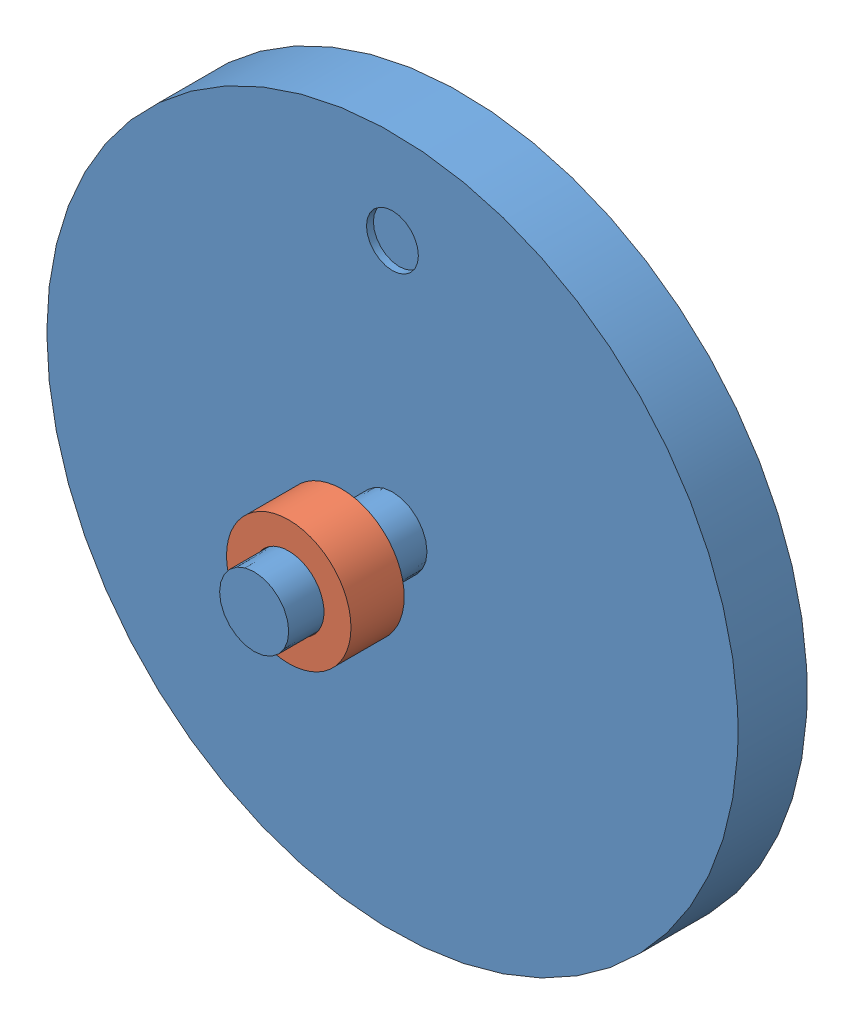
SolidWorks assembly cylindrePleinPlat.SLDASM, configuration Défaut (file format 7000). Lengths in mm.
Overall size (1000 1000 300).
2 component instances, 2 part files, 2 mates.
Components (placement in the parent):
- cyclindrePleinPlat-1: cyclindrePleinPlat.SLDPRT [Défaut] at (121.53 -174.1093 900) size (1000 1000 300)
- Support-1: Support.SLDPRT [Défaut] at (121.53 -174.1093 1073) size (180 180 77)
Mates (geometry in assembly coordinates):
- Coaxiale1: concentric aligned: cylinder of cyclindrePleinPlat-1 through (121.53 -174.1093 1200) axis (0 0 -1) radius 50; cylinder of Support-1 through (121.53 -174.1093 1150) axis (0 0 -1) radius 51
- Distance1: distance = 50 mm aligned: plane of Support-1 through (121.53 -174.1093 1150) normal (0 0 1); plane of cyclindrePleinPlat-1 through (121.53 -174.1093 1200) normal (0 0 1)
